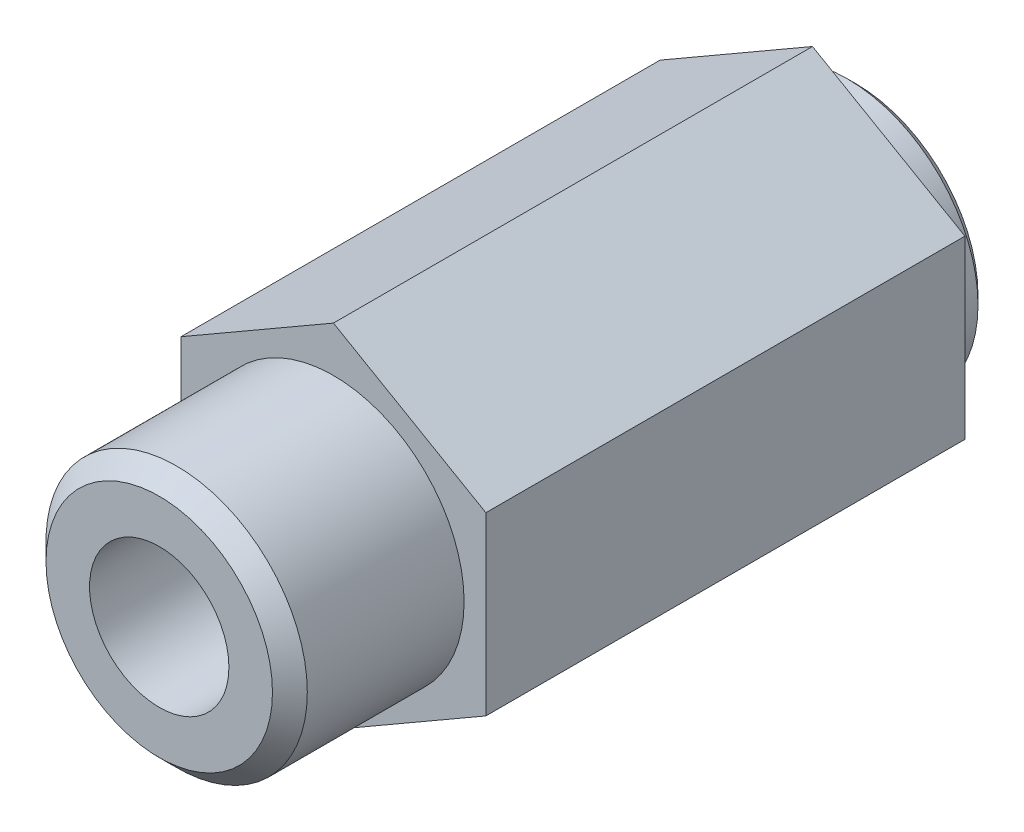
ISO-10303-21;
HEADER;
FILE_DESCRIPTION(('STEP AP214'),'2;1');
FILE_NAME('part.step','',(''),(''),'','','');
FILE_SCHEMA(('AUTOMOTIVE_DESIGN { 1 0 10303 214 1 1 1 1 }'));
ENDSEC;
DATA;
#1=APPLICATION_CONTEXT('core data for automotive mechanical design processes');
#2=APPLICATION_PROTOCOL_DEFINITION('international standard','automotive_design',2000,#1);
#3=PRODUCT_CONTEXT('',#1,'mechanical');
#4=PRODUCT('Part','Part','',(#3));
#5=PRODUCT_RELATED_PRODUCT_CATEGORY('part','',(#4));
#6=PRODUCT_DEFINITION_FORMATION('','',#4);
#7=PRODUCT_DEFINITION_CONTEXT('part definition',#1,'design');
#8=PRODUCT_DEFINITION('design','',#6,#7);
#9=PRODUCT_DEFINITION_SHAPE('','',#8);
#10=(LENGTH_UNIT() NAMED_UNIT(*) SI_UNIT(.MILLI.,.METRE.));
#11=(NAMED_UNIT(*) PLANE_ANGLE_UNIT() SI_UNIT($,.RADIAN.));
#12=(NAMED_UNIT(*) SI_UNIT($,.STERADIAN.) SOLID_ANGLE_UNIT());
#13=UNCERTAINTY_MEASURE_WITH_UNIT(LENGTH_MEASURE(1.E-05),#10,'distance_accuracy_value','');
#14=(GEOMETRIC_REPRESENTATION_CONTEXT(3) GLOBAL_UNCERTAINTY_ASSIGNED_CONTEXT((#13)) GLOBAL_UNIT_ASSIGNED_CONTEXT((#10,
#11,#12)) REPRESENTATION_CONTEXT('',''));
#15=CARTESIAN_POINT('',(0.,0.,0.));
#16=DIRECTION('',(0.,0.,1.));
#17=DIRECTION('',(1.,0.,0.));
#18=AXIS2_PLACEMENT_3D('',#15,#16,#17);
#19=CARTESIAN_POINT('',(17.5,10.1036297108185,55.));
#20=DIRECTION('',(-0.5,-0.866025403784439,0.));
#21=DIRECTION('',(0.866025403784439,-0.5,0.));
#22=AXIS2_PLACEMENT_3D('',#19,#20,#21);
#23=PLANE('',#22);
#24=DIRECTION('',(-0.866025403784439,0.5,0.));
#25=VECTOR('',#24,1.);
#26=CARTESIAN_POINT('',(17.5,10.1036297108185,0.));
#27=LINE('',#26,#25);
#28=CARTESIAN_POINT('',(17.5,10.1036297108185,0.));
#29=VERTEX_POINT('',#28);
#30=CARTESIAN_POINT('',(0.,20.2072594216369,0.));
#31=VERTEX_POINT('',#30);
#32=EDGE_CURVE('E123',#29,#31,#27,.T.);
#33=ORIENTED_EDGE('',*,*,#32,.T.);
#34=DIRECTION('',(0.,0.,-1.));
#35=VECTOR('',#34,1.);
#36=CARTESIAN_POINT('',(0.,20.2072594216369,55.));
#37=LINE('',#36,#35);
#38=CARTESIAN_POINT('',(0.,20.2072594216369,55.));
#39=VERTEX_POINT('',#38);
#40=EDGE_CURVE('E141',#39,#31,#37,.T.);
#41=ORIENTED_EDGE('',*,*,#40,.F.);
#42=DIRECTION('',(-0.866025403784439,0.5,0.));
#43=VECTOR('',#42,1.);
#44=CARTESIAN_POINT('',(17.5,10.1036297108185,55.));
#45=LINE('',#44,#43);
#46=CARTESIAN_POINT('',(17.5,10.1036297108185,55.));
#47=VERTEX_POINT('',#46);
#48=EDGE_CURVE('E134',#47,#39,#45,.T.);
#49=ORIENTED_EDGE('',*,*,#48,.F.);
#50=DIRECTION('',(0.,0.,-1.));
#51=VECTOR('',#50,1.);
#52=CARTESIAN_POINT('',(17.5,10.1036297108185,55.));
#53=LINE('',#52,#51);
#54=EDGE_CURVE('E119',#47,#29,#53,.T.);
#55=ORIENTED_EDGE('',*,*,#54,.T.);
#56=EDGE_LOOP('',(#33,#41,#49,#55));
#57=FACE_BOUND('',#56,.T.);
#58=ADVANCED_FACE('F37',(#57),#23,.F.);
#59=CARTESIAN_POINT('',(0.,20.2072594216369,55.));
#60=DIRECTION('',(0.5,-0.866025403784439,0.));
#61=DIRECTION('',(0.866025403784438,0.5,0.));
#62=AXIS2_PLACEMENT_3D('',#59,#60,#61);
#63=PLANE('',#62);
#64=DIRECTION('',(-0.866025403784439,-0.5,0.));
#65=VECTOR('',#64,1.);
#66=CARTESIAN_POINT('',(0.,20.2072594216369,0.));
#67=LINE('',#66,#65);
#68=CARTESIAN_POINT('',(-17.5,10.1036297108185,0.));
#69=VERTEX_POINT('',#68);
#70=EDGE_CURVE('E126',#31,#69,#67,.T.);
#71=ORIENTED_EDGE('',*,*,#70,.T.);
#72=DIRECTION('',(0.,0.,-1.));
#73=VECTOR('',#72,1.);
#74=CARTESIAN_POINT('',(-17.5,10.1036297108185,55.));
#75=LINE('',#74,#73);
#76=CARTESIAN_POINT('',(-17.5,10.1036297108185,55.));
#77=VERTEX_POINT('',#76);
#78=EDGE_CURVE('E138',#77,#69,#75,.T.);
#79=ORIENTED_EDGE('',*,*,#78,.F.);
#80=DIRECTION('',(-0.866025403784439,-0.5,0.));
#81=VECTOR('',#80,1.);
#82=CARTESIAN_POINT('',(0.,20.2072594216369,55.));
#83=LINE('',#82,#81);
#84=EDGE_CURVE('E92',#39,#77,#83,.T.);
#85=ORIENTED_EDGE('',*,*,#84,.F.);
#86=ORIENTED_EDGE('',*,*,#40,.T.);
#87=EDGE_LOOP('',(#71,#79,#85,#86));
#88=FACE_BOUND('',#87,.T.);
#89=ADVANCED_FACE('F167',(#88),#63,.F.);
#90=CARTESIAN_POINT('',(-17.5,10.1036297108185,55.));
#91=DIRECTION('',(1.,0.,0.));
#92=DIRECTION('',(0.,1.,0.));
#93=AXIS2_PLACEMENT_3D('',#90,#91,#92);
#94=PLANE('',#93);
#95=DIRECTION('',(0.,-1.,0.));
#96=VECTOR('',#95,1.);
#97=CARTESIAN_POINT('',(-17.5,10.1036297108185,0.));
#98=LINE('',#97,#96);
#99=CARTESIAN_POINT('',(-17.5,-10.1036297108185,0.));
#100=VERTEX_POINT('',#99);
#101=EDGE_CURVE('E129',#69,#100,#98,.T.);
#102=ORIENTED_EDGE('',*,*,#101,.T.);
#103=DIRECTION('',(0.,0.,-1.));
#104=VECTOR('',#103,1.);
#105=CARTESIAN_POINT('',(-17.5,-10.1036297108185,55.));
#106=LINE('',#105,#104);
#107=CARTESIAN_POINT('',(-17.5,-10.1036297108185,55.));
#108=VERTEX_POINT('',#107);
#109=EDGE_CURVE('E114',#108,#100,#106,.T.);
#110=ORIENTED_EDGE('',*,*,#109,.F.);
#111=DIRECTION('',(0.,-1.,0.));
#112=VECTOR('',#111,1.);
#113=CARTESIAN_POINT('',(-17.5,10.1036297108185,55.));
#114=LINE('',#113,#112);
#115=EDGE_CURVE('E105',#77,#108,#114,.T.);
#116=ORIENTED_EDGE('',*,*,#115,.F.);
#117=ORIENTED_EDGE('',*,*,#78,.T.);
#118=EDGE_LOOP('',(#102,#110,#116,#117));
#119=FACE_BOUND('',#118,.T.);
#120=ADVANCED_FACE('F173',(#119),#94,.F.);
#121=CARTESIAN_POINT('',(-17.5,-10.1036297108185,55.));
#122=DIRECTION('',(0.5,0.866025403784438,0.));
#123=DIRECTION('',(-0.866025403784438,0.5,0.));
#124=AXIS2_PLACEMENT_3D('',#121,#122,#123);
#125=PLANE('',#124);
#126=DIRECTION('',(0.866025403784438,-0.5,0.));
#127=VECTOR('',#126,1.);
#128=CARTESIAN_POINT('',(-17.5,-10.1036297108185,0.));
#129=LINE('',#128,#127);
#130=CARTESIAN_POINT('',(0.,-20.2072594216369,0.));
#131=VERTEX_POINT('',#130);
#132=EDGE_CURVE('E113',#100,#131,#129,.T.);
#133=ORIENTED_EDGE('',*,*,#132,.T.);
#134=DIRECTION('',(0.,0.,-1.));
#135=VECTOR('',#134,1.);
#136=CARTESIAN_POINT('',(0.,-20.2072594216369,55.));
#137=LINE('',#136,#135);
#138=CARTESIAN_POINT('',(0.,-20.2072594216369,55.));
#139=VERTEX_POINT('',#138);
#140=EDGE_CURVE('E110',#139,#131,#137,.T.);
#141=ORIENTED_EDGE('',*,*,#140,.F.);
#142=DIRECTION('',(0.866025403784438,-0.5,0.));
#143=VECTOR('',#142,1.);
#144=CARTESIAN_POINT('',(-17.5,-10.1036297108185,55.));
#145=LINE('',#144,#143);
#146=EDGE_CURVE('E99',#108,#139,#145,.T.);
#147=ORIENTED_EDGE('',*,*,#146,.F.);
#148=ORIENTED_EDGE('',*,*,#109,.T.);
#149=EDGE_LOOP('',(#133,#141,#147,#148));
#150=FACE_BOUND('',#149,.T.);
#151=ADVANCED_FACE('F111',(#150),#125,.F.);
#152=CARTESIAN_POINT('',(0.,-20.2072594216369,55.));
#153=DIRECTION('',(-0.5,0.866025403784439,0.));
#154=DIRECTION('',(-0.866025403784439,-0.5,0.));
#155=AXIS2_PLACEMENT_3D('',#152,#153,#154);
#156=PLANE('',#155);
#157=DIRECTION('',(0.866025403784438,0.5,0.));
#158=VECTOR('',#157,1.);
#159=CARTESIAN_POINT('',(0.,-20.2072594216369,0.));
#160=LINE('',#159,#158);
#161=CARTESIAN_POINT('',(17.5,-10.1036297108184,0.));
#162=VERTEX_POINT('',#161);
#163=EDGE_CURVE('E77',#131,#162,#160,.T.);
#164=ORIENTED_EDGE('',*,*,#163,.T.);
#165=DIRECTION('',(0.,0.,-1.));
#166=VECTOR('',#165,1.);
#167=CARTESIAN_POINT('',(17.5,-10.1036297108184,55.));
#168=LINE('',#167,#166);
#169=CARTESIAN_POINT('',(17.5,-10.1036297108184,55.));
#170=VERTEX_POINT('',#169);
#171=EDGE_CURVE('E115',#170,#162,#168,.T.);
#172=ORIENTED_EDGE('',*,*,#171,.F.);
#173=DIRECTION('',(0.866025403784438,0.5,0.));
#174=VECTOR('',#173,1.);
#175=CARTESIAN_POINT('',(0.,-20.2072594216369,55.));
#176=LINE('',#175,#174);
#177=EDGE_CURVE('E103',#139,#170,#176,.T.);
#178=ORIENTED_EDGE('',*,*,#177,.F.);
#179=ORIENTED_EDGE('',*,*,#140,.T.);
#180=EDGE_LOOP('',(#164,#172,#178,#179));
#181=FACE_BOUND('',#180,.T.);
#182=ADVANCED_FACE('F117',(#181),#156,.F.);
#183=CARTESIAN_POINT('',(17.5,-10.1036297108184,55.));
#184=DIRECTION('',(-1.,0.,0.));
#185=DIRECTION('',(0.,0.,1.));
#186=AXIS2_PLACEMENT_3D('',#183,#184,#185);
#187=PLANE('',#186);
#188=DIRECTION('',(0.,1.,0.));
#189=VECTOR('',#188,1.);
#190=CARTESIAN_POINT('',(17.5,-10.1036297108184,0.));
#191=LINE('',#190,#189);
#192=EDGE_CURVE('E83',#162,#29,#191,.T.);
#193=ORIENTED_EDGE('',*,*,#192,.T.);
#194=ORIENTED_EDGE('',*,*,#54,.F.);
#195=DIRECTION('',(0.,1.,0.));
#196=VECTOR('',#195,1.);
#197=CARTESIAN_POINT('',(17.5,-10.1036297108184,55.));
#198=LINE('',#197,#196);
#199=EDGE_CURVE('E54',#170,#47,#198,.T.);
#200=ORIENTED_EDGE('',*,*,#199,.F.);
#201=ORIENTED_EDGE('',*,*,#171,.T.);
#202=EDGE_LOOP('',(#193,#194,#200,#201));
#203=FACE_BOUND('',#202,.T.);
#204=ADVANCED_FACE('F183',(#203),#187,.F.);
#205=CARTESIAN_POINT('',(0.,0.,55.));
#206=DIRECTION('',(0.,0.,1.));
#207=DIRECTION('',(1.,0.,0.));
#208=AXIS2_PLACEMENT_3D('',#205,#206,#207);
#209=PLANE('',#208);
#210=CARTESIAN_POINT('',(0.,0.,55.));
#211=DIRECTION('',(0.,0.,1.));
#212=DIRECTION('',(1.,0.,0.));
#213=AXIS2_PLACEMENT_3D('',#210,#211,#212);
#214=CIRCLE('',#213,15.);
#215=CARTESIAN_POINT('',(15.,0.,55.));
#216=VERTEX_POINT('',#215);
#217=EDGE_CURVE('E127',#216,#216,#214,.T.);
#218=ORIENTED_EDGE('',*,*,#217,.F.);
#219=EDGE_LOOP('',(#218));
#220=FACE_BOUND('',#219,.T.);
#221=ORIENTED_EDGE('',*,*,#48,.T.);
#222=ORIENTED_EDGE('',*,*,#84,.T.);
#223=ORIENTED_EDGE('',*,*,#115,.T.);
#224=ORIENTED_EDGE('',*,*,#146,.T.);
#225=ORIENTED_EDGE('',*,*,#177,.T.);
#226=ORIENTED_EDGE('',*,*,#199,.T.);
#227=EDGE_LOOP('',(#221,#222,#223,#224,#225,#226));
#228=FACE_BOUND('',#227,.T.);
#229=ADVANCED_FACE('F101',(#220,#228),#209,.T.);
#230=CARTESIAN_POINT('',(0.,0.,0.));
#231=DIRECTION('',(0.,0.,1.));
#232=DIRECTION('',(1.,0.,0.));
#233=AXIS2_PLACEMENT_3D('',#230,#231,#232);
#234=PLANE('',#233);
#235=CARTESIAN_POINT('',(0.,0.,0.));
#236=DIRECTION('',(0.,0.,1.));
#237=DIRECTION('',(1.,0.,0.));
#238=AXIS2_PLACEMENT_3D('',#235,#236,#237);
#239=CIRCLE('',#238,15.);
#240=CARTESIAN_POINT('',(15.,0.,0.));
#241=VERTEX_POINT('',#240);
#242=EDGE_CURVE('E143',#241,#241,#239,.F.);
#243=ORIENTED_EDGE('',*,*,#242,.F.);
#244=EDGE_LOOP('',(#243));
#245=FACE_BOUND('',#244,.T.);
#246=ORIENTED_EDGE('',*,*,#32,.F.);
#247=ORIENTED_EDGE('',*,*,#192,.F.);
#248=ORIENTED_EDGE('',*,*,#163,.F.);
#249=ORIENTED_EDGE('',*,*,#132,.F.);
#250=ORIENTED_EDGE('',*,*,#101,.F.);
#251=ORIENTED_EDGE('',*,*,#70,.F.);
#252=EDGE_LOOP('',(#246,#247,#248,#249,#250,#251));
#253=FACE_BOUND('',#252,.T.);
#254=ADVANCED_FACE('F186',(#245,#253),#234,.F.);
#255=CARTESIAN_POINT('',(0.,0.,75.));
#256=DIRECTION('',(0.,0.,-1.));
#257=DIRECTION('',(-1.,0.,0.));
#258=AXIS2_PLACEMENT_3D('',#255,#256,#257);
#259=CYLINDRICAL_SURFACE('',#258,15.);
#260=CARTESIAN_POINT('',(0.,0.,73.));
#261=DIRECTION('',(0.,0.,1.));
#262=DIRECTION('',(1.,0.,0.));
#263=AXIS2_PLACEMENT_3D('',#260,#261,#262);
#264=CIRCLE('',#263,15.);
#265=CARTESIAN_POINT('',(15.,0.,73.));
#266=VERTEX_POINT('',#265);
#267=EDGE_CURVE('E149',#266,#266,#264,.F.);
#268=ORIENTED_EDGE('',*,*,#267,.T.);
#269=EDGE_LOOP('',(#268));
#270=FACE_BOUND('',#269,.T.);
#271=ORIENTED_EDGE('',*,*,#217,.T.);
#272=EDGE_LOOP('',(#271));
#273=FACE_BOUND('',#272,.T.);
#274=ADVANCED_FACE('F189',(#270,#273),#259,.T.);
#275=CARTESIAN_POINT('',(0.,0.,75.));
#276=DIRECTION('',(0.,0.,1.));
#277=DIRECTION('',(1.,0.,0.));
#278=AXIS2_PLACEMENT_3D('',#275,#276,#277);
#279=PLANE('',#278);
#280=CARTESIAN_POINT('',(0.,0.,75.));
#281=DIRECTION('',(0.,0.,1.));
#282=DIRECTION('',(1.,0.,0.));
#283=AXIS2_PLACEMENT_3D('',#280,#281,#282);
#284=CIRCLE('',#283,13.);
#285=CARTESIAN_POINT('',(13.,0.,75.));
#286=VERTEX_POINT('',#285);
#287=EDGE_CURVE('E146',#286,#286,#284,.T.);
#288=ORIENTED_EDGE('',*,*,#287,.T.);
#289=EDGE_LOOP('',(#288));
#290=FACE_BOUND('',#289,.T.);
#291=CARTESIAN_POINT('',(0.,0.,75.));
#292=DIRECTION('',(0.,0.,1.));
#293=DIRECTION('',(1.,0.,0.));
#294=AXIS2_PLACEMENT_3D('',#291,#292,#293);
#295=CIRCLE('',#294,8.);
#296=CARTESIAN_POINT('',(8.,0.,75.));
#297=VERTEX_POINT('',#296);
#298=EDGE_CURVE('E225',#297,#297,#295,.T.);
#299=ORIENTED_EDGE('',*,*,#298,.F.);
#300=EDGE_LOOP('',(#299));
#301=FACE_BOUND('',#300,.T.);
#302=ADVANCED_FACE('F196',(#290,#301),#279,.T.);
#303=CARTESIAN_POINT('',(0.,0.,-5.));
#304=DIRECTION('',(0.,0.,1.));
#305=DIRECTION('',(1.,0.,0.));
#306=AXIS2_PLACEMENT_3D('',#303,#304,#305);
#307=CYLINDRICAL_SURFACE('',#306,15.);
#308=CARTESIAN_POINT('',(0.,0.,-4.));
#309=DIRECTION('',(0.,0.,-1.));
#310=DIRECTION('',(-1.,0.,0.));
#311=AXIS2_PLACEMENT_3D('',#308,#309,#310);
#312=CIRCLE('',#311,15.);
#313=CARTESIAN_POINT('',(-15.,0.,-4.));
#314=VERTEX_POINT('',#313);
#315=EDGE_CURVE('E11',#314,#314,#312,.F.);
#316=ORIENTED_EDGE('',*,*,#315,.T.);
#317=EDGE_LOOP('',(#316));
#318=FACE_BOUND('',#317,.T.);
#319=ORIENTED_EDGE('',*,*,#242,.T.);
#320=EDGE_LOOP('',(#319));
#321=FACE_BOUND('',#320,.T.);
#322=ADVANCED_FACE('F200',(#318,#321),#307,.T.);
#323=CARTESIAN_POINT('',(0.,0.,-5.));
#324=DIRECTION('',(0.,0.,-1.));
#325=DIRECTION('',(-1.,0.,0.));
#326=AXIS2_PLACEMENT_3D('',#323,#324,#325);
#327=PLANE('',#326);
#328=CARTESIAN_POINT('',(0.,0.,-5.));
#329=DIRECTION('',(0.,0.,-1.));
#330=DIRECTION('',(-1.,0.,0.));
#331=AXIS2_PLACEMENT_3D('',#328,#329,#330);
#332=CIRCLE('',#331,14.);
#333=CARTESIAN_POINT('',(-14.,0.,-5.));
#334=VERTEX_POINT('',#333);
#335=EDGE_CURVE('E46',#334,#334,#332,.T.);
#336=ORIENTED_EDGE('',*,*,#335,.T.);
#337=EDGE_LOOP('',(#336));
#338=FACE_BOUND('',#337,.T.);
#339=CARTESIAN_POINT('',(0.,0.,-5.));
#340=DIRECTION('',(0.,0.,-1.));
#341=DIRECTION('',(-1.,0.,0.));
#342=AXIS2_PLACEMENT_3D('',#339,#340,#341);
#343=CIRCLE('',#342,10.);
#344=CARTESIAN_POINT('',(-10.,0.,-5.));
#345=VERTEX_POINT('',#344);
#346=EDGE_CURVE('E228',#345,#345,#343,.T.);
#347=ORIENTED_EDGE('',*,*,#346,.F.);
#348=EDGE_LOOP('',(#347));
#349=FACE_BOUND('',#348,.T.);
#350=ADVANCED_FACE('F154',(#338,#349),#327,.T.);
#351=CARTESIAN_POINT('',(0.,0.,35.));
#352=DIRECTION('',(0.,0.,-1.));
#353=DIRECTION('',(-1.,0.,0.));
#354=AXIS2_PLACEMENT_3D('',#351,#352,#353);
#355=CYLINDRICAL_SURFACE('',#354,10.);
#356=CARTESIAN_POINT('',(0.,0.,35.));
#357=DIRECTION('',(0.,0.,-1.));
#358=DIRECTION('',(-1.,0.,0.));
#359=AXIS2_PLACEMENT_3D('',#356,#357,#358);
#360=CIRCLE('',#359,10.);
#361=CARTESIAN_POINT('',(-10.,0.,35.));
#362=VERTEX_POINT('',#361);
#363=EDGE_CURVE('E231',#362,#362,#360,.T.);
#364=ORIENTED_EDGE('',*,*,#363,.F.);
#365=EDGE_LOOP('',(#364));
#366=FACE_BOUND('',#365,.T.);
#367=ORIENTED_EDGE('',*,*,#346,.T.);
#368=EDGE_LOOP('',(#367));
#369=FACE_BOUND('',#368,.T.);
#370=ADVANCED_FACE('F207',(#366,#369),#355,.F.);
#371=CARTESIAN_POINT('',(0.,0.,35.));
#372=DIRECTION('',(0.,0.,-1.));
#373=DIRECTION('',(-1.,0.,0.));
#374=AXIS2_PLACEMENT_3D('',#371,#372,#373);
#375=PLANE('',#374);
#376=CARTESIAN_POINT('',(0.,0.,35.));
#377=DIRECTION('',(0.,0.,1.));
#378=DIRECTION('',(1.,0.,0.));
#379=AXIS2_PLACEMENT_3D('',#376,#377,#378);
#380=CIRCLE('',#379,8.);
#381=CARTESIAN_POINT('',(8.,0.,35.));
#382=VERTEX_POINT('',#381);
#383=EDGE_CURVE('E222',#382,#382,#380,.T.);
#384=ORIENTED_EDGE('',*,*,#383,.T.);
#385=EDGE_LOOP('',(#384));
#386=FACE_BOUND('',#385,.T.);
#387=ORIENTED_EDGE('',*,*,#363,.T.);
#388=EDGE_LOOP('',(#387));
#389=FACE_BOUND('',#388,.T.);
#390=ADVANCED_FACE('F210',(#386,#389),#375,.T.);
#391=CARTESIAN_POINT('',(0.,0.,35.));
#392=DIRECTION('',(0.,0.,1.));
#393=DIRECTION('',(1.,0.,0.));
#394=AXIS2_PLACEMENT_3D('',#391,#392,#393);
#395=CYLINDRICAL_SURFACE('',#394,8.);
#396=ORIENTED_EDGE('',*,*,#383,.F.);
#397=EDGE_LOOP('',(#396));
#398=FACE_BOUND('',#397,.T.);
#399=ORIENTED_EDGE('',*,*,#298,.T.);
#400=EDGE_LOOP('',(#399));
#401=FACE_BOUND('',#400,.T.);
#402=ADVANCED_FACE('F163',(#398,#401),#395,.F.);
#403=CARTESIAN_POINT('',(0.,0.,75.));
#404=DIRECTION('',(0.,0.,-1.));
#405=DIRECTION('',(-1.,0.,0.));
#406=AXIS2_PLACEMENT_3D('',#403,#404,#405);
#407=CONICAL_SURFACE('',#406,13.,0.785398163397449);
#408=ORIENTED_EDGE('',*,*,#267,.F.);
#409=EDGE_LOOP('',(#408));
#410=FACE_BOUND('',#409,.T.);
#411=ORIENTED_EDGE('',*,*,#287,.F.);
#412=EDGE_LOOP('',(#411));
#413=FACE_BOUND('',#412,.T.);
#414=ADVANCED_FACE('F158',(#410,#413),#407,.T.);
#415=CARTESIAN_POINT('',(0.,0.,-5.));
#416=DIRECTION('',(0.,0.,1.));
#417=DIRECTION('',(1.,0.,0.));
#418=AXIS2_PLACEMENT_3D('',#415,#416,#417);
#419=CONICAL_SURFACE('',#418,14.,0.785398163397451);
#420=ORIENTED_EDGE('',*,*,#315,.F.);
#421=EDGE_LOOP('',(#420));
#422=FACE_BOUND('',#421,.T.);
#423=ORIENTED_EDGE('',*,*,#335,.F.);
#424=EDGE_LOOP('',(#423));
#425=FACE_BOUND('',#424,.T.);
#426=ADVANCED_FACE('F39',(#422,#425),#419,.T.);
#427=CLOSED_SHELL('',(#58,#89,#120,#151,#182,#204,#229,#254,#274,#302,#322,#350,#370,#390,#402,
#414,#426));
#428=MANIFOLD_SOLID_BREP('B2',#427);
#429=ADVANCED_BREP_SHAPE_REPRESENTATION('',(#18,#428),#14);
#430=SHAPE_DEFINITION_REPRESENTATION(#9,#429);
ENDSEC;
END-ISO-10303-21;
